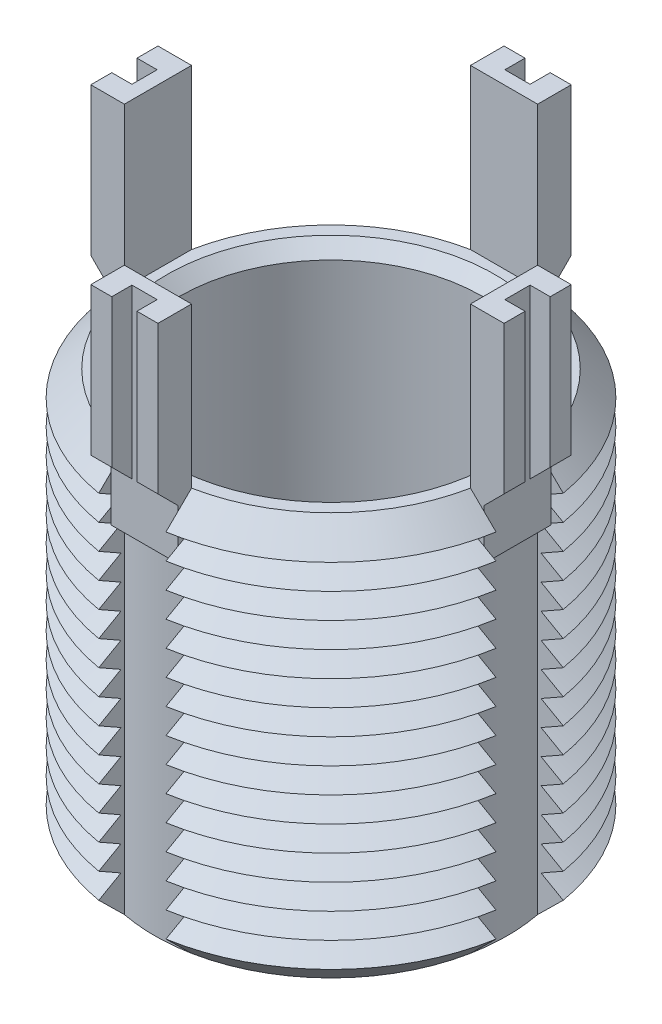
from build123d import *

# Parameters (mm, degrees)
SKETCH1_R               = 12
BOSS_EXTRUDE1_DEPTH     = 24
CHAMFER1_SIZE           = 1.5
LPATTERN1_COUNT         = 14
LPATTERN1_PITCH         = 1.5
CUT_EXTRUDE1_REACH      = 31.394
CIRPATTERN1_COUNT       = 4
BOSS_EXTRUDE3_DEPTH     = 2
CIRPATTERN2_COUNT       = 4
CUT_EXTRUDE3_DEPTH      = 38.751981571
CUT_EXTRUDE3_DEPTH_BACK = 38.751981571
SKETCH6_W               = 1.2
SKETCH6_H               = 1.5
SKETCH6_W_2             = 1.5
SKETCH6_H_2             = 1.2
SKETCH7_R               = 9
CUT_EXTRUDE4_DEPTH      = 24
CHAMFER2_SIZE           = 0.75


with BuildPart() as part:
    # Sketch1 → Boss-Extrude1 (new body)
    with BuildSketch(Plane(origin=(0, 0, 0), x_dir=(1, 0, 0), z_dir=(0, 1, 0))):
        with Locations(Location((0, 0, 0), (0, 0, 270))):
            Circle(SKETCH1_R)
    extrude(amount=-BOSS_EXTRUDE1_DEPTH)

    # Chamfer1
    chamfer1_edges = [part.edges().sort_by_distance(p)[0] for p in [
        (0, 0, -12),
        (0, -24, -12),
    ]]
    chamfer(chamfer1_edges, length=CHAMFER1_SIZE)

    # Sketch3 → Cut-Revolve1 (revolve, cut)
    with BuildSketch(Plane(origin=(0, 0, 0), x_dir=(0, 0, -1), z_dir=(1, 0, 0))):
        Polygon((-12, -1.5), (-10.700961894, -2.25), (-12, -3), align=None)
    cut_revolve1 = revolve(axis=Axis((0, 0.885892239, 0), (0, -1, 0)), mode=Mode.SUBTRACT)

    # LPattern1: Cut-Revolve1 ×14
    with Locations(*[(0, -i * LPATTERN1_PITCH, 0) for i in range(1, LPATTERN1_COUNT)]):
        add(cut_revolve1, mode=Mode.SUBTRACT)

    # Cut-Extrude1: up to this cone (the profile starts inside it)
    cut_extrude1_end = Plane(origin=(0, 0, 0), z_dir=(0, 1, 0)).offset(-34.499999) * Cone(1e-06, 100.894, 100.893999, align=(Align.CENTER, Align.CENTER, Align.MIN), mode=Mode.PRIVATE)
    # Sketch4 → Cut-Extrude1 (cut, up to the surface)
    with BuildSketch(Plane(origin=(0, 0, 0), x_dir=(1, 0, 0), z_dir=(0, 1, 0)), mode=Mode.PRIVATE) as cut_extrude1_sk1:
        with BuildLine():
            Line((-10.307764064, 2), (-11.832159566, 2))
            ThreePointArc((-11.832159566, 2), (-12, 0), (-11.832159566, -2))
            Line((-11.832159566, -2), (-10.307764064, -2))
            ThreePointArc((-10.307764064, -2), (-10.5, 0), (-10.307764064, 2))
        make_face()
    cut_extrude1_tool1 = extrude(cut_extrude1_sk1.sketch, amount=-CUT_EXTRUDE1_REACH, mode=Mode.PRIVATE) & cut_extrude1_end
    cut_extrude1 = cut_extrude1_tool1.solids().sort_by_distance((-11.189927, 0, 0))[0]
    add(cut_extrude1, mode=Mode.SUBTRACT)

    # CirPattern1: Cut-Extrude1 ×4 about axis
    cirpattern1_axis = Axis((0, 0, 0), (0, 1, 0))
    for i in range(1, CIRPATTERN1_COUNT):
        add(cut_extrude1.rotate(cirpattern1_axis, i * 360 / CIRPATTERN1_COUNT), mode=Mode.SUBTRACT)

    # Sketch5 → Boss-Extrude3 (add, symmetric)
    with BuildSketch(Plane(origin=(0, 0, 0), x_dir=(0, 0, -1), z_dir=(1, 0, 0))):
        Polygon((-10.307764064, 9.5), (-10.307764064, -3.5), (-11.107764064, -3.5), (-11.107764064, -0.5), (-12.307764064, 0.7), (-12.307764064, 9.5), align=None)
    boss_extrude3 = extrude(amount=BOSS_EXTRUDE3_DEPTH, both=True)

    # CirPattern2: Boss-Extrude3 ×4 about axis
    cirpattern2_axis = Axis((0, 0, 0), (0, 1, 0))
    for i in range(1, CIRPATTERN2_COUNT):
        add(boss_extrude3.rotate(cirpattern2_axis, i * 360 / CIRPATTERN2_COUNT))

    # Sketch6 → Cut-Extrude3 (cut, two sides: drawn at the far end of the back side and taken through both)
    with BuildSketch(Plane(origin=(0, 9.5, 0), x_dir=(1, 0, 0), z_dir=(0, 1, 0)).offset(-CUT_EXTRUDE3_DEPTH_BACK)):
        with Locations((-11.707764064, 0)):
            Rectangle(SKETCH6_W, SKETCH6_H)
        with Locations((0, 11.707764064)):
            Rectangle(SKETCH6_W_2, SKETCH6_H_2)
        with Locations((11.707764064, 0)):
            Rectangle(SKETCH6_W, SKETCH6_H)
        with Locations((0, -11.707764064)):
            Rectangle(SKETCH6_W_2, SKETCH6_H_2)
    extrude(amount=CUT_EXTRUDE3_DEPTH + CUT_EXTRUDE3_DEPTH_BACK, mode=Mode.SUBTRACT)

    # Sketch7 → Cut-Extrude4 (cut)
    with BuildSketch(Plane(origin=(0, 0, 0), x_dir=(1, 0, 0), z_dir=(0, 1, 0))):
        with Locations(Location((0, 0, 0), (0, 0, 270))):
            Circle(SKETCH7_R)
    extrude(amount=-CUT_EXTRUDE4_DEPTH, mode=Mode.SUBTRACT)

    # Chamfer2
    chamfer2_edges = [part.edges().sort_by_distance(p)[0] for p in [
        (0, 0, -9),
        (0, -24, -9),
    ]]
    chamfer(chamfer2_edges, length=CHAMFER2_SIZE)


solid = part.part
